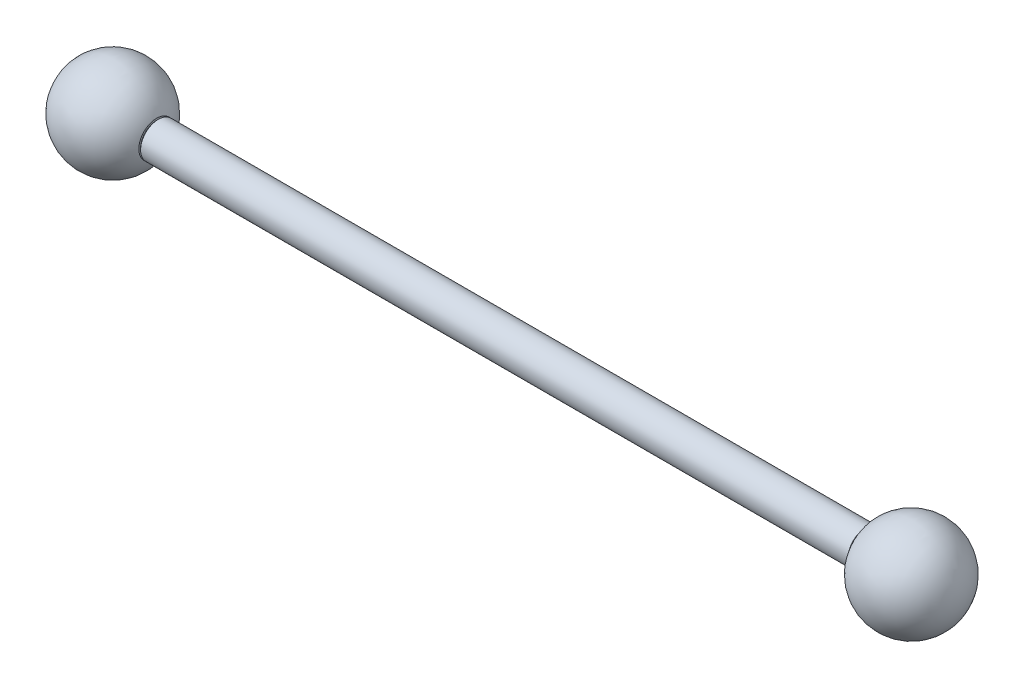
from build123d import *

# Parameters (mm, degrees)
CHAMFER_1_SIZE = 0.15
CHAMFER_2_SIZE = 0.15


with BuildPart() as part:
    # Sketch 2 → Revolve 1 (revolve)
    with BuildSketch(Plane.XY, mode=Mode.PRIVATE) as revolve_1_sk:
        with BuildLine():
            Line((30.041900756, 1.5), (30.041900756, 1))
            Line((30.041900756, 1), (33.149139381, 1))
            Line((33.149139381, 1), (33.75, 0))
            Line((33.75, 0), (37.75, 0))
            ThreePointArc((37.75, 0), (34.51406905, 3.92634671), (30.041900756, 1.5))
        make_face()
        with BuildLine():
            Line((-33.75, 0), (-37.75, 0))
            ThreePointArc((-37.75, 0), (-34.51406905, 3.92634671), (-30.041900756, 1.5))
            Line((-30.041900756, 1.5), (-30.041900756, 1))
            Line((-30.041900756, 1), (-33.149139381, 1))
            Line((-33.149139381, 1), (-33.75, 0))
        make_face()
    revolve(revolve_1_sk.sketch.rotate(Axis((-33.75, 0, 0), (1, 0, 0)), 180), axis=Axis((-33.75, 0, 0), (1, 0, 0)))

    # Chamfer 1
    chamfer_1_edges = [part.edges().sort_by_distance(p)[0] for p in [
        (-30.041900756, 1, 0),
    ]]
    chamfer(chamfer_1_edges, length=CHAMFER_1_SIZE)

    # Chamfer 2
    chamfer_2_edges = [part.edges().sort_by_distance(p)[0] for p in [
        (30.041900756, 1, 0),
    ]]
    chamfer(chamfer_2_edges, length=CHAMFER_2_SIZE)


with BuildPart() as body_2:
    # Sketch 3 → Revolve 2 (revolve)
    with BuildSketch(Plane.XY, mode=Mode.PRIVATE) as revolve_2_sk:
        Polygon((-33.149139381, 0), (33.149139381, 0), (33.149139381, 0.85), (32.999139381, 1), (30.191900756, 1), (30.041900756, 1.15), (30.041900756, 1.35), (29.891900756, 1.5), (-29.891900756, 1.5), (-30.041900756, 1.35), (-30.041900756, 1.15), (-30.191900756, 1), (-32.999139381, 1), (-33.149139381, 0.85), align=None)
    revolve(revolve_2_sk.sketch.rotate(Axis((-33.149139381, 0, 0), (1, 0, 0)), 180), axis=Axis((-33.149139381, 0, 0), (1, 0, 0)))


solid = Compound([part.part, body_2.part])
